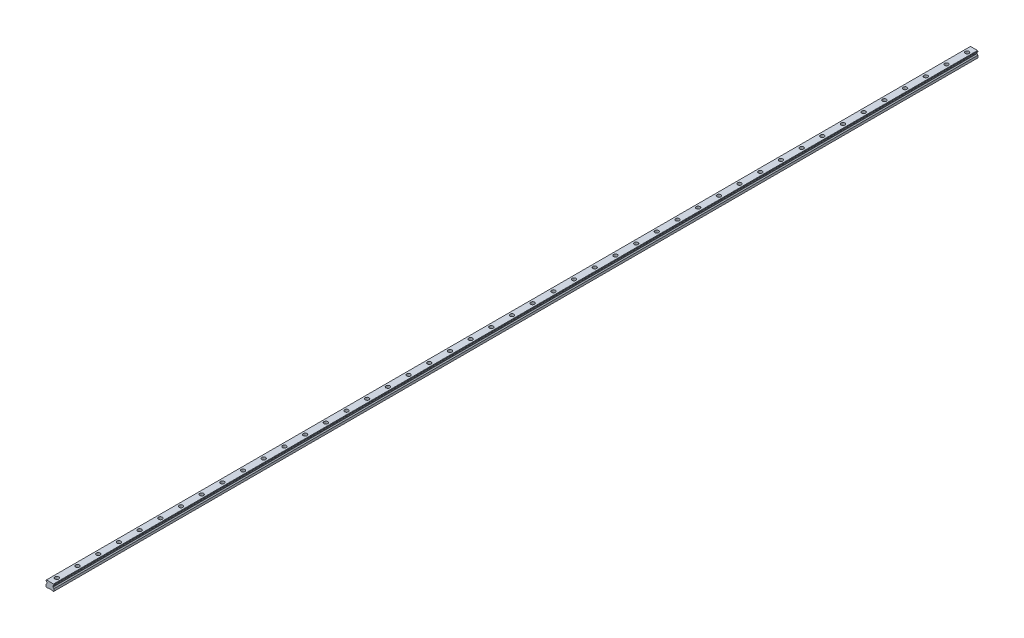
from build123d import *

# Parameters (mm, degrees)
SKETCH1_W           = 23
SKETCH1_H           = 19.2
BOSS_EXTRUDE1_DEPTH = 1340
CUT_EXTRUDE1_DEPTH  = 2681.093447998
CHAMFER1_SIZE       = 1.25
FILLET1_R           = 1.25
CUT_EXTRUDE2_DEPTH  = 2681.093447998
SKETCH4_R           = 5.5
SKETCH4_R_2         = 3.5
CUT_EXTRUDE3_DEPTH  = 9
SKETCH4_2_R         = 3.5
CUT_EXTRUDE4_DEPTH  = 1341.186886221
LPATTERN1_COUNT     = 45
LPATTERN1_PITCH     = 60


with BuildPart() as part:
    # Sketch1 → Boss-Extrude1 (new, symmetric)
    with BuildSketch(Plane.XY):
        with Locations((0, 9.6)):
            Rectangle(SKETCH1_W, SKETCH1_H)
    extrude(amount=BOSS_EXTRUDE1_DEPTH, both=True)

    # Sketch2 → Cut-Extrude1 (cut, through all)
    with BuildSketch(Plane.XY.offset(1340)):
        Polygon((-11.5, 16.7), (-11.5, 7.95), (-8.583333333, 10.866666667), (-8.583333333, 13.783333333), align=None)
        Polygon((8.583333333, 13.783333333), (11.5, 16.7), (11.5, 7.95), (8.583333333, 10.866666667), align=None)
    extrude(amount=-CUT_EXTRUDE1_DEPTH, mode=Mode.SUBTRACT)

    # Chamfer1
    chamfer1_edges = [part.edges().sort_by_distance(p)[0] for p in [
        (-11.5, 19.2, 0),
        (11.5, 19.2, 0),
        (11.5, 0, 0),
        (-11.5, 0, 0),
    ]]
    chamfer(chamfer1_edges, length=CHAMFER1_SIZE)

    # Fillet1
    fillet1_edges = [part.edges().sort_by_distance(p)[0] for p in [
        (-8.583333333, 13.783333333, 0),
        (-8.583333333, 10.866666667, 0),
        (8.583333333, 10.866666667, 0),
        (8.583333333, 13.783333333, 0),
    ]]
    fillet(fillet1_edges, radius=FILLET1_R)

    # Sketch3 → Cut-Extrude2 (cut, through all)
    with BuildSketch(Plane.XY.offset(1340)):
        Polygon((-7, 0), (-5.75, 1.25), (5.75, 1.25), (7, 0), align=None)
    extrude(amount=-CUT_EXTRUDE2_DEPTH, mode=Mode.SUBTRACT)

    # Sketch4 → Cut-Extrude3 (cut)
    with BuildSketch(Plane(origin=(0, 19.2, 0), x_dir=(1, 0, 0), z_dir=(0, 1, 0))):
        with Locations(Location((0, -1320, 0), (0, 0, 270))):
            Circle(SKETCH4_R)
        with Locations(Location((0, -1320, 0), (0, 0, 270))):
            Circle(SKETCH4_R_2, mode=Mode.SUBTRACT)
    cut_extrude3 = extrude(amount=-CUT_EXTRUDE3_DEPTH, mode=Mode.SUBTRACT)

    # Sketch4_2 → Cut-Extrude4 (cut, through all)
    with BuildSketch(Plane(origin=(0, 19.2, 0), x_dir=(1, 0, 0), z_dir=(0, 1, 0))):
        with Locations(Location((0, -1320, 0), (0, 0, 270))):
            Circle(SKETCH4_2_R)
    cut_extrude4 = extrude(amount=-CUT_EXTRUDE4_DEPTH, mode=Mode.SUBTRACT)

    # LPattern1: Cut-Extrude3, Cut-Extrude4 ×45
    with Locations(*[(0, 0, -i * LPATTERN1_PITCH) for i in range(1, LPATTERN1_COUNT)]):
        add(cut_extrude3, mode=Mode.SUBTRACT)
        add(cut_extrude4, mode=Mode.SUBTRACT)


solid = part.part
